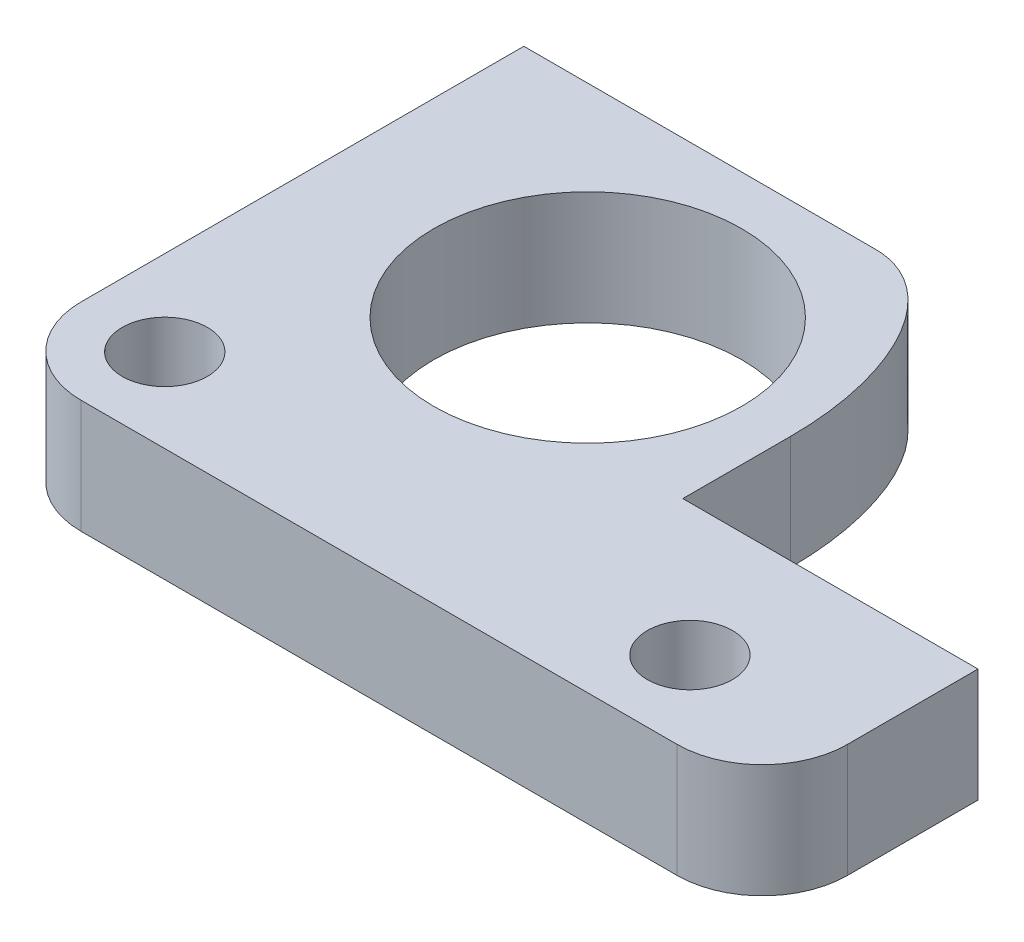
ISO-10303-21;
HEADER;
FILE_DESCRIPTION(('STEP AP214'),'2;1');
FILE_NAME('part.step','',(''),(''),'','','');
FILE_SCHEMA(('AUTOMOTIVE_DESIGN { 1 0 10303 214 1 1 1 1 }'));
ENDSEC;
DATA;
#1=APPLICATION_CONTEXT('core data for automotive mechanical design processes');
#2=APPLICATION_PROTOCOL_DEFINITION('international standard','automotive_design',2000,#1);
#3=PRODUCT_CONTEXT('',#1,'mechanical');
#4=PRODUCT('Part','Part','',(#3));
#5=PRODUCT_RELATED_PRODUCT_CATEGORY('part','',(#4));
#6=PRODUCT_DEFINITION_FORMATION('','',#4);
#7=PRODUCT_DEFINITION_CONTEXT('part definition',#1,'design');
#8=PRODUCT_DEFINITION('design','',#6,#7);
#9=PRODUCT_DEFINITION_SHAPE('','',#8);
#10=(LENGTH_UNIT() NAMED_UNIT(*) SI_UNIT(.MILLI.,.METRE.));
#11=(NAMED_UNIT(*) PLANE_ANGLE_UNIT() SI_UNIT($,.RADIAN.));
#12=(NAMED_UNIT(*) SI_UNIT($,.STERADIAN.) SOLID_ANGLE_UNIT());
#13=UNCERTAINTY_MEASURE_WITH_UNIT(LENGTH_MEASURE(1.E-05),#10,'distance_accuracy_value','');
#14=(GEOMETRIC_REPRESENTATION_CONTEXT(3) GLOBAL_UNCERTAINTY_ASSIGNED_CONTEXT((#13)) GLOBAL_UNIT_ASSIGNED_CONTEXT((#10,
#11,#12)) REPRESENTATION_CONTEXT('',''));
#15=CARTESIAN_POINT('',(0.,0.,0.));
#16=DIRECTION('',(0.,0.,1.));
#17=DIRECTION('',(1.,0.,0.));
#18=AXIS2_PLACEMENT_3D('',#15,#16,#17);
#19=CARTESIAN_POINT('',(0.,2.,0.));
#20=DIRECTION('',(0.,1.,0.));
#21=DIRECTION('',(0.,0.,1.));
#22=AXIS2_PLACEMENT_3D('',#19,#20,#21);
#23=PLANE('',#22);
#24=CARTESIAN_POINT('',(-4.1,2.,3.275));
#25=DIRECTION('',(0.,1.,0.));
#26=DIRECTION('',(0.,0.,1.));
#27=AXIS2_PLACEMENT_3D('',#24,#25,#26);
#28=CIRCLE('',#27,5.425);
#29=CARTESIAN_POINT('',(-4.1,2.,8.7));
#30=VERTEX_POINT('',#29);
#31=EDGE_CURVE('E223',#30,#30,#28,.F.);
#32=ORIENTED_EDGE('',*,*,#31,.T.);
#33=EDGE_LOOP('',(#32));
#34=FACE_BOUND('',#33,.T.);
#35=CARTESIAN_POINT('',(-10.5,2.,11.775));
#36=DIRECTION('',(0.,1.,0.));
#37=DIRECTION('',(0.,0.,1.));
#38=AXIS2_PLACEMENT_3D('',#35,#36,#37);
#39=CIRCLE('',#38,1.5);
#40=CARTESIAN_POINT('',(-10.5,2.,13.275));
#41=VERTEX_POINT('',#40);
#42=EDGE_CURVE('E316',#41,#41,#39,.F.);
#43=ORIENTED_EDGE('',*,*,#42,.T.);
#44=EDGE_LOOP('',(#43));
#45=FACE_BOUND('',#44,.T.);
#46=CARTESIAN_POINT('',(8.,2.,11.775));
#47=DIRECTION('',(0.,1.,0.));
#48=DIRECTION('',(0.,0.,1.));
#49=AXIS2_PLACEMENT_3D('',#46,#47,#48);
#50=CIRCLE('',#49,1.5);
#51=CARTESIAN_POINT('',(8.,2.,13.275));
#52=VERTEX_POINT('',#51);
#53=EDGE_CURVE('E288',#52,#52,#50,.F.);
#54=ORIENTED_EDGE('',*,*,#53,.T.);
#55=EDGE_LOOP('',(#54));
#56=FACE_BOUND('',#55,.T.);
#57=DIRECTION('',(0.,0.,-1.));
#58=VECTOR('',#57,1.);
#59=CARTESIAN_POINT('',(13.5,2.,11.725));
#60=LINE('',#59,#58);
#61=CARTESIAN_POINT('',(13.5,2.,7.125));
#62=VERTEX_POINT('',#61);
#63=CARTESIAN_POINT('',(13.5,2.,11.725));
#64=VERTEX_POINT('',#63);
#65=EDGE_CURVE('E130',#62,#64,#60,.F.);
#66=ORIENTED_EDGE('',*,*,#65,.F.);
#67=DIRECTION('',(-1.,0.,0.));
#68=VECTOR('',#67,1.);
#69=CARTESIAN_POINT('',(13.5,2.,7.125));
#70=LINE('',#69,#68);
#71=CARTESIAN_POINT('',(3.1,2.,7.125));
#72=VERTEX_POINT('',#71);
#73=EDGE_CURVE('E126',#72,#62,#70,.F.);
#74=ORIENTED_EDGE('',*,*,#73,.F.);
#75=DIRECTION('',(0.,0.,-1.));
#76=VECTOR('',#75,1.);
#77=CARTESIAN_POINT('',(3.1,2.,7.125));
#78=LINE('',#77,#76);
#79=CARTESIAN_POINT('',(3.10001855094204,2.,3.32500000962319));
#80=VERTEX_POINT('',#79);
#81=EDGE_CURVE('E113',#80,#72,#78,.F.);
#82=ORIENTED_EDGE('',*,*,#81,.F.);
#83=CARTESIAN_POINT('',(3.10003710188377,2.,3.32500001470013));
#84=CARTESIAN_POINT('',(3.10007453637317,2.,3.2140764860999));
#85=CARTESIAN_POINT('',(3.09861347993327,2.,3.10315693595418));
#86=CARTESIAN_POINT('',(3.09266903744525,2.,2.88139930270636));
#87=CARTESIAN_POINT('',(3.08818566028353,2.,2.77056121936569));
#88=CARTESIAN_POINT('',(3.07012608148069,2.,2.43757906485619));
#89=CARTESIAN_POINT('',(3.05193981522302,2.,2.21566843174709));
#90=CARTESIAN_POINT('',(3.00332272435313,2.,1.77290547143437));
#91=CARTESIAN_POINT('',(2.97287611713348,2.,1.55205488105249));
#92=CARTESIAN_POINT('',(2.89867700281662,2.,1.11027900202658));
#93=CARTESIAN_POINT('',(2.85479243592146,2.,0.88937575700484));
#94=CARTESIAN_POINT('',(2.7533377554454,2.,0.450930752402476));
#95=CARTESIAN_POINT('',(2.69578180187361,2.,0.233385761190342));
#96=CARTESIAN_POINT('',(2.5983834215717,2.,-0.0894541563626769));
#97=CARTESIAN_POINT('',(2.5640904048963,2.,-0.196442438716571));
#98=CARTESIAN_POINT('',(2.49171222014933,2.,-0.409127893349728));
#99=CARTESIAN_POINT('',(2.45362720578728,2.,-0.514825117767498));
#100=CARTESIAN_POINT('',(2.36121377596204,2.,-0.756757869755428));
#101=CARTESIAN_POINT('',(2.30547713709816,2.,-0.89245978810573));
#102=CARTESIAN_POINT('',(2.18676976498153,2.,-1.16067094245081));
#103=CARTESIAN_POINT('',(2.12379903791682,2.,-1.29318018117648));
#104=CARTESIAN_POINT('',(1.99027434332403,2.,-1.55414631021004));
#105=CARTESIAN_POINT('',(1.91972930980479,2.,-1.68260774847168));
#106=CARTESIAN_POINT('',(1.77028706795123,2.,-1.9345683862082));
#107=CARTESIAN_POINT('',(1.69139198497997,2.,-2.05806883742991));
#108=CARTESIAN_POINT('',(1.5371411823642,2.,-2.28103440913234));
#109=CARTESIAN_POINT('',(1.46300492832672,2.,-2.38134197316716));
#110=CARTESIAN_POINT('',(1.30784214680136,2.,-2.57655108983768));
#111=CARTESIAN_POINT('',(1.22681432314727,2.,-2.67145161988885));
#112=CARTESIAN_POINT('',(1.05764352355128,2.,-2.8544260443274));
#113=CARTESIAN_POINT('',(0.969511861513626,2.,-2.94251037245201));
#114=CARTESIAN_POINT('',(0.786057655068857,2.,-3.11083030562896));
#115=CARTESIAN_POINT('',(0.690739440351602,2.,-3.19107057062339));
#116=CARTESIAN_POINT('',(0.52610368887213,2.,-3.31567313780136));
#117=CARTESIAN_POINT('',(0.458989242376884,2.,-3.36294634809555));
#118=CARTESIAN_POINT('',(0.32139484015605,2.,-3.45232204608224));
#119=CARTESIAN_POINT('',(0.250915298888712,2.,-3.49442516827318));
#120=CARTESIAN_POINT('',(0.107044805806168,2.,-3.5728141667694));
#121=CARTESIAN_POINT('',(0.0336625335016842,2.,-3.60911595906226));
#122=CARTESIAN_POINT('',(-0.115826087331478,2.,-3.67563823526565));
#123=CARTESIAN_POINT('',(-0.191932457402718,2.,-3.70585867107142));
#124=CARTESIAN_POINT('',(-0.335691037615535,2.,-3.75556163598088));
#125=CARTESIAN_POINT('',(-0.403026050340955,2.,-3.77595674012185));
#126=CARTESIAN_POINT('',(-0.505045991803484,2.,-3.80252865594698));
#127=CARTESIAN_POINT('',(-0.539219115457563,2.,-3.81071528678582));
#128=CARTESIAN_POINT('',(-0.607861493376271,2.,-3.82574358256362));
#129=CARTESIAN_POINT('',(-0.642330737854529,2.,-3.83258529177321));
#130=CARTESIAN_POINT('',(-0.711793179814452,2.,-3.84484062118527));
#131=CARTESIAN_POINT('',(-0.746788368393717,2.,-3.85024300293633));
#132=CARTESIAN_POINT('',(-0.816989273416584,2.,-3.85948306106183));
#133=CARTESIAN_POINT('',(-0.852195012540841,2.,-3.86332056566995));
#134=CARTESIAN_POINT('',(-0.922802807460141,2.,-3.86941073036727));
#135=CARTESIAN_POINT('',(-0.958205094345,2.,-3.87166070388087));
#136=CARTESIAN_POINT('',(-1.02907290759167,2.,-3.87459281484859));
#137=CARTESIAN_POINT('',(-1.06453843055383,2.,-3.87527503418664));
#138=CARTESIAN_POINT('',(-1.10000043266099,2.,-3.87518725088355));
#139=B_SPLINE_CURVE_WITH_KNOTS('',3,(#83,#84,#85,#86,#87,#88,#89,#90,#91,#92,#93,#94,#95,#96,
#97,#98,#99,#100,#101,#102,#103,#104,#105,#106,#107,#108,#109,#110,#111,#112,#113,#114,#115,
#116,#117,#118,#119,#120,#121,#122,#123,#124,#125,#126,#127,#128,#129,#130,#131,#132,#133,#134,
#135,#136,#137,#138),.UNSPECIFIED.,.F.,.F.,(4,2,2,2,2,2,2,2,2,2,2,2,2,2,2,2,2,2,2,2,2,2,2,2,2,2,
2,4),(0.,0.332751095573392,0.665501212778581,1.33310256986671,2.00156608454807,2.67682196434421,
3.3513814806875,3.68837046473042,4.02534579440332,4.46525038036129,4.90515459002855,
5.34454551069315,5.78382485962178,6.1577554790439,6.53175658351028,6.90517337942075,
7.27836697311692,7.52443921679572,7.77048123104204,8.01583618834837,8.26119308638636,
8.47202715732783,8.57742538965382,8.68282015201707,8.78901521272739,8.89522192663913,
9.00160794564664,9.10798840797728),.UNSPECIFIED.);
#140=CARTESIAN_POINT('',(-1.10000021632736,2.,-3.87509362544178));
#141=VERTEX_POINT('',#140);
#142=EDGE_CURVE('E146',#80,#141,#139,.T.);
#143=ORIENTED_EDGE('',*,*,#142,.T.);
#144=DIRECTION('',(-1.,0.,0.));
#145=VECTOR('',#144,1.);
#146=CARTESIAN_POINT('',(-1.1,2.,-3.875));
#147=LINE('',#146,#145);
#148=CARTESIAN_POINT('',(-13.5,2.,-3.875));
#149=VERTEX_POINT('',#148);
#150=EDGE_CURVE('E171',#149,#141,#147,.F.);
#151=ORIENTED_EDGE('',*,*,#150,.F.);
#152=DIRECTION('',(0.,0.,1.));
#153=VECTOR('',#152,1.);
#154=CARTESIAN_POINT('',(-13.5,2.,-3.875));
#155=LINE('',#154,#153);
#156=CARTESIAN_POINT('',(-13.5,2.,11.725));
#157=VERTEX_POINT('',#156);
#158=EDGE_CURVE('E86',#157,#149,#155,.F.);
#159=ORIENTED_EDGE('',*,*,#158,.F.);
#160=CARTESIAN_POINT('',(-10.5,2.,11.725));
#161=DIRECTION('',(0.,1.,0.));
#162=DIRECTION('',(0.,0.,1.));
#163=AXIS2_PLACEMENT_3D('',#160,#161,#162);
#164=CIRCLE('',#163,3.);
#165=CARTESIAN_POINT('',(-10.5,2.,14.725));
#166=VERTEX_POINT('',#165);
#167=EDGE_CURVE('E78',#166,#157,#164,.F.);
#168=ORIENTED_EDGE('',*,*,#167,.F.);
#169=DIRECTION('',(1.,0.,0.));
#170=VECTOR('',#169,1.);
#171=CARTESIAN_POINT('',(-10.5,2.,14.725));
#172=LINE('',#171,#170);
#173=CARTESIAN_POINT('',(10.5,2.,14.725));
#174=VERTEX_POINT('',#173);
#175=EDGE_CURVE('E72',#174,#166,#172,.F.);
#176=ORIENTED_EDGE('',*,*,#175,.F.);
#177=CARTESIAN_POINT('',(10.5,2.,11.725));
#178=DIRECTION('',(0.,1.,0.));
#179=DIRECTION('',(0.,0.,1.));
#180=AXIS2_PLACEMENT_3D('',#177,#178,#179);
#181=CIRCLE('',#180,3.);
#182=EDGE_CURVE('E300',#64,#174,#181,.F.);
#183=ORIENTED_EDGE('',*,*,#182,.F.);
#184=EDGE_LOOP('',(#66,#74,#82,#143,#151,#159,#168,#176,#183));
#185=FACE_BOUND('',#184,.T.);
#186=ADVANCED_FACE('F17',(#34,#45,#56,#185),#23,.T.);
#187=CARTESIAN_POINT('',(13.5,-2.,7.125));
#188=DIRECTION('',(0.,0.,-1.));
#189=DIRECTION('',(-1.,0.,0.));
#190=AXIS2_PLACEMENT_3D('',#187,#188,#189);
#191=PLANE('',#190);
#192=DIRECTION('',(0.,1.,0.));
#193=VECTOR('',#192,1.);
#194=CARTESIAN_POINT('',(13.5,-2.,7.125));
#195=LINE('',#194,#193);
#196=CARTESIAN_POINT('',(13.5,-2.,7.125));
#197=VERTEX_POINT('',#196);
#198=EDGE_CURVE('E157',#197,#62,#195,.T.);
#199=ORIENTED_EDGE('',*,*,#198,.F.);
#200=DIRECTION('',(1.,0.,0.));
#201=VECTOR('',#200,1.);
#202=CARTESIAN_POINT('',(0.,-2.,7.125));
#203=LINE('',#202,#201);
#204=CARTESIAN_POINT('',(3.1,-2.,7.125));
#205=VERTEX_POINT('',#204);
#206=EDGE_CURVE('E139',#197,#205,#203,.F.);
#207=ORIENTED_EDGE('',*,*,#206,.T.);
#208=DIRECTION('',(0.,1.,0.));
#209=VECTOR('',#208,1.);
#210=CARTESIAN_POINT('',(3.1,-2.,7.125));
#211=LINE('',#210,#209);
#212=EDGE_CURVE('E118',#72,#205,#211,.F.);
#213=ORIENTED_EDGE('',*,*,#212,.F.);
#214=ORIENTED_EDGE('',*,*,#73,.T.);
#215=EDGE_LOOP('',(#199,#207,#213,#214));
#216=FACE_BOUND('',#215,.T.);
#217=ADVANCED_FACE('F137',(#216),#191,.T.);
#218=CARTESIAN_POINT('',(3.1,-2.,7.125));
#219=DIRECTION('',(1.,0.,0.));
#220=DIRECTION('',(0.,0.,-1.));
#221=AXIS2_PLACEMENT_3D('',#218,#219,#220);
#222=PLANE('',#221);
#223=ORIENTED_EDGE('',*,*,#212,.T.);
#224=DIRECTION('',(0.,0.,1.));
#225=VECTOR('',#224,1.);
#226=CARTESIAN_POINT('',(3.1,-2.,0.));
#227=LINE('',#226,#225);
#228=CARTESIAN_POINT('',(3.10001855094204,-2.,3.32500000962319));
#229=VERTEX_POINT('',#228);
#230=EDGE_CURVE('E281',#205,#229,#227,.F.);
#231=ORIENTED_EDGE('',*,*,#230,.T.);
#232=CARTESIAN_POINT('',(3.10003710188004,2.,3.3250000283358));
#233=DIRECTION('',(0.,-1.,0.));
#234=VECTOR('',#233,1.);
#235=LINE('',#232,#234);
#236=EDGE_CURVE('E120',#229,#80,#235,.F.);
#237=ORIENTED_EDGE('',*,*,#236,.T.);
#238=ORIENTED_EDGE('',*,*,#81,.T.);
#239=EDGE_LOOP('',(#223,#231,#237,#238));
#240=FACE_BOUND('',#239,.T.);
#241=ADVANCED_FACE('F115',(#240),#222,.T.);
#242=CARTESIAN_POINT('',(-1.231925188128,-2.,-3.871447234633));
#243=CARTESIAN_POINT('',(-0.9793425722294,-2.,-3.885054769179));
#244=CARTESIAN_POINT('',(-0.5480025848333,-2.,-3.835776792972));
#245=CARTESIAN_POINT('',(0.1671228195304,-2.,-3.584334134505));
#246=CARTESIAN_POINT('',(0.8789481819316,-2.,-3.081369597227));
#247=CARTESIAN_POINT('',(1.561186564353,-2.,-2.29964631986));
#248=CARTESIAN_POINT('',(2.10916645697,-2.,-1.378812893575));
#249=CARTESIAN_POINT('',(2.541157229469,-2.,-0.3377988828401));
#250=CARTESIAN_POINT('',(2.861422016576,-2.,0.8189785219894));
#251=CARTESIAN_POINT('',(3.06380102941,-2.,2.097901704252));
#252=CARTESIAN_POINT('',(3.107200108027,-2.,3.045344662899));
#253=CARTESIAN_POINT('',(3.097927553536,-2.,3.551157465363));
#254=(BOUNDED_CURVE() B_SPLINE_CURVE(3,(#242,#243,#244,#245,#246,#247,#248,#249,#250,#251,#252,
#253),.UNSPECIFIED.,.F.,.F.) B_SPLINE_CURVE_WITH_KNOTS((4,1,1,1,1,1,1,1,1,4),(0.,0.0625,0.125,
0.25,0.375,0.5,0.625,0.75,0.875,1.),
.UNSPECIFIED.) CURVE() GEOMETRIC_REPRESENTATION_ITEM() RATIONAL_B_SPLINE_CURVE((1.,1.,1.,1.,1.,
1.,1.,1.,1.,1.,1.,1.)) REPRESENTATION_ITEM(''));
#255=DIRECTION('',(0.,1.,0.));
#256=VECTOR('',#255,1.);
#257=SURFACE_OF_LINEAR_EXTRUSION('',#254,#256);
#258=ORIENTED_EDGE('',*,*,#142,.F.);
#259=ORIENTED_EDGE('',*,*,#236,.F.);
#260=CARTESIAN_POINT('',(3.10003710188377,-2.,3.32500001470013));
#261=CARTESIAN_POINT('',(3.10007453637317,-2.,3.2140764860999));
#262=CARTESIAN_POINT('',(3.09861347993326,-2.,3.10315693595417));
#263=CARTESIAN_POINT('',(3.09266903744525,-2.,2.88139930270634));
#264=CARTESIAN_POINT('',(3.08818566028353,-2.,2.77056121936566));
#265=CARTESIAN_POINT('',(3.07012608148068,-2.,2.43757906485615));
#266=CARTESIAN_POINT('',(3.05193981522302,-2.,2.21566843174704));
#267=CARTESIAN_POINT('',(3.00332272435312,-2.,1.77290547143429));
#268=CARTESIAN_POINT('',(2.97287611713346,-2.,1.5520548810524));
#269=CARTESIAN_POINT('',(2.8986770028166,-2.,1.11027900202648));
#270=CARTESIAN_POINT('',(2.85479243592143,-2.,0.889375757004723));
#271=CARTESIAN_POINT('',(2.75333775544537,-2.,0.450930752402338));
#272=CARTESIAN_POINT('',(2.69578180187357,-2.,0.233385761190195));
#273=CARTESIAN_POINT('',(2.59838342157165,-2.,-0.0894541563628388));
#274=CARTESIAN_POINT('',(2.56409040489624,-2.,-0.196442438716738));
#275=CARTESIAN_POINT('',(2.49171222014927,-2.,-0.409127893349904));
#276=CARTESIAN_POINT('',(2.45362720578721,-2.,-0.514825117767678));
#277=CARTESIAN_POINT('',(2.36121377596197,-2.,-0.756757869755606));
#278=CARTESIAN_POINT('',(2.30547713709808,-2.,-0.892459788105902));
#279=CARTESIAN_POINT('',(2.18676976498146,-2.,-1.16067094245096));
#280=CARTESIAN_POINT('',(2.12379903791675,-2.,-1.29318018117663));
#281=CARTESIAN_POINT('',(1.99027434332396,-2.,-1.55414631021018));
#282=CARTESIAN_POINT('',(1.91972930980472,-2.,-1.68260774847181));
#283=CARTESIAN_POINT('',(1.77028706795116,-2.,-1.93456838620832));
#284=CARTESIAN_POINT('',(1.69139198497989,-2.,-2.05806883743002));
#285=CARTESIAN_POINT('',(1.53714118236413,-2.,-2.28103440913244));
#286=CARTESIAN_POINT('',(1.46300492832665,-2.,-2.38134197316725));
#287=CARTESIAN_POINT('',(1.30784214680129,-2.,-2.57655108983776));
#288=CARTESIAN_POINT('',(1.2268143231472,-2.,-2.67145161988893));
#289=CARTESIAN_POINT('',(1.05764352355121,-2.,-2.85442604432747));
#290=CARTESIAN_POINT('',(0.969511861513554,-2.,-2.94251037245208));
#291=CARTESIAN_POINT('',(0.786057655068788,-2.,-3.11083030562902));
#292=CARTESIAN_POINT('',(0.690739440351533,-2.,-3.19107057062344));
#293=CARTESIAN_POINT('',(0.526103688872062,-2.,-3.31567313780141));
#294=CARTESIAN_POINT('',(0.458989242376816,-2.,-3.3629463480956));
#295=CARTESIAN_POINT('',(0.321394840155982,-2.,-3.45232204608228));
#296=CARTESIAN_POINT('',(0.250915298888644,-2.,-3.49442516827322));
#297=CARTESIAN_POINT('',(0.107044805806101,-2.,-3.57281416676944));
#298=CARTESIAN_POINT('',(0.0336625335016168,-2.,-3.60911595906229));
#299=CARTESIAN_POINT('',(-0.115826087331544,-2.,-3.67563823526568));
#300=CARTESIAN_POINT('',(-0.191932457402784,-2.,-3.70585867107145));
#301=CARTESIAN_POINT('',(-0.335691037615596,-2.,-3.75556163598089));
#302=CARTESIAN_POINT('',(-0.403026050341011,-2.,-3.77595674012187));
#303=CARTESIAN_POINT('',(-0.505045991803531,-2.,-3.80252865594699));
#304=CARTESIAN_POINT('',(-0.539219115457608,-2.,-3.81071528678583));
#305=CARTESIAN_POINT('',(-0.60786149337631,-2.,-3.82574358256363));
#306=CARTESIAN_POINT('',(-0.642330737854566,-2.,-3.83258529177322));
#307=CARTESIAN_POINT('',(-0.711793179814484,-2.,-3.84484062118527));
#308=CARTESIAN_POINT('',(-0.746788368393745,-2.,-3.85024300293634));
#309=CARTESIAN_POINT('',(-0.816989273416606,-2.,-3.85948306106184));
#310=CARTESIAN_POINT('',(-0.85219501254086,-2.,-3.86332056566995));
#311=CARTESIAN_POINT('',(-0.922802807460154,-2.,-3.86941073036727));
#312=CARTESIAN_POINT('',(-0.958205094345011,-2.,-3.87166070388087));
#313=CARTESIAN_POINT('',(-1.02907290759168,-2.,-3.8745928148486));
#314=CARTESIAN_POINT('',(-1.06453843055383,-2.,-3.87527503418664));
#315=CARTESIAN_POINT('',(-1.10000043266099,-2.,-3.87518725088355));
#316=B_SPLINE_CURVE_WITH_KNOTS('',3,(#260,#261,#262,#263,#264,#265,#266,#267,#268,#269,#270,
#271,#272,#273,#274,#275,#276,#277,#278,#279,#280,#281,#282,#283,#284,#285,#286,#287,#288,#289,
#290,#291,#292,#293,#294,#295,#296,#297,#298,#299,#300,#301,#302,#303,#304,#305,#306,#307,#308,
#309,#310,#311,#312,#313,#314,#315),.UNSPECIFIED.,.F.,.F.,(4,2,2,2,2,2,2,2,2,2,2,2,2,2,2,2,2,2,
2,2,2,2,2,2,2,2,2,4),(0.,0.332751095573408,0.665501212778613,1.33310256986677,2.00156608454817,
2.67682196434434,3.35138148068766,3.6883704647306,4.02534579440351,4.46525038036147,
4.90515459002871,5.34454551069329,5.78382485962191,6.15775547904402,6.53175658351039,
6.90517337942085,7.27836697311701,7.5244392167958,7.77048123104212,8.01583618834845,
8.26119308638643,8.47202715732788,8.57742538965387,8.6828201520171,8.78901521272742,
8.89522192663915,9.00160794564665,9.10798840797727),.UNSPECIFIED.);
#317=CARTESIAN_POINT('',(-1.10000021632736,-2.,-3.87509362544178));
#318=VERTEX_POINT('',#317);
#319=EDGE_CURVE('E221',#229,#318,#316,.T.);
#320=ORIENTED_EDGE('',*,*,#319,.T.);
#321=CARTESIAN_POINT('',(-1.10000043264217,-2.,-3.87518725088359));
#322=DIRECTION('',(0.,1.,0.));
#323=VECTOR('',#322,1.);
#324=LINE('',#321,#323);
#325=EDGE_CURVE('E168',#141,#318,#324,.F.);
#326=ORIENTED_EDGE('',*,*,#325,.F.);
#327=EDGE_LOOP('',(#258,#259,#320,#326));
#328=FACE_BOUND('',#327,.T.);
#329=ADVANCED_FACE('F197',(#328),#257,.F.);
#330=CARTESIAN_POINT('',(-1.1,-2.,-3.875));
#331=DIRECTION('',(0.,0.,-1.));
#332=DIRECTION('',(-1.,0.,0.));
#333=AXIS2_PLACEMENT_3D('',#330,#331,#332);
#334=PLANE('',#333);
#335=ORIENTED_EDGE('',*,*,#325,.T.);
#336=DIRECTION('',(1.,0.,0.));
#337=VECTOR('',#336,1.);
#338=CARTESIAN_POINT('',(0.,-2.,-3.875));
#339=LINE('',#338,#337);
#340=CARTESIAN_POINT('',(-13.5,-2.,-3.875));
#341=VERTEX_POINT('',#340);
#342=EDGE_CURVE('E270',#318,#341,#339,.F.);
#343=ORIENTED_EDGE('',*,*,#342,.T.);
#344=DIRECTION('',(0.,1.,0.));
#345=VECTOR('',#344,1.);
#346=CARTESIAN_POINT('',(-13.5,-2.,-3.875));
#347=LINE('',#346,#345);
#348=EDGE_CURVE('E167',#149,#341,#347,.F.);
#349=ORIENTED_EDGE('',*,*,#348,.F.);
#350=ORIENTED_EDGE('',*,*,#150,.T.);
#351=EDGE_LOOP('',(#335,#343,#349,#350));
#352=FACE_BOUND('',#351,.T.);
#353=ADVANCED_FACE('F187',(#352),#334,.T.);
#354=CARTESIAN_POINT('',(-13.5,-2.,-3.875));
#355=DIRECTION('',(-1.,0.,0.));
#356=DIRECTION('',(0.,0.,1.));
#357=AXIS2_PLACEMENT_3D('',#354,#355,#356);
#358=PLANE('',#357);
#359=ORIENTED_EDGE('',*,*,#348,.T.);
#360=DIRECTION('',(0.,0.,1.));
#361=VECTOR('',#360,1.);
#362=CARTESIAN_POINT('',(-13.5,-2.,0.));
#363=LINE('',#362,#361);
#364=CARTESIAN_POINT('',(-13.5,-2.,11.725));
#365=VERTEX_POINT('',#364);
#366=EDGE_CURVE('E266',#341,#365,#363,.T.);
#367=ORIENTED_EDGE('',*,*,#366,.T.);
#368=DIRECTION('',(0.,1.,0.));
#369=VECTOR('',#368,1.);
#370=CARTESIAN_POINT('',(-13.5,-2.,11.725));
#371=LINE('',#370,#369);
#372=EDGE_CURVE('E165',#157,#365,#371,.F.);
#373=ORIENTED_EDGE('',*,*,#372,.F.);
#374=ORIENTED_EDGE('',*,*,#158,.T.);
#375=EDGE_LOOP('',(#359,#367,#373,#374));
#376=FACE_BOUND('',#375,.T.);
#377=ADVANCED_FACE('F196',(#376),#358,.T.);
#378=CARTESIAN_POINT('',(-10.5,-2.,11.725));
#379=DIRECTION('',(0.,1.,0.));
#380=DIRECTION('',(0.,0.,1.));
#381=AXIS2_PLACEMENT_3D('',#378,#379,#380);
#382=CYLINDRICAL_SURFACE('',#381,3.);
#383=ORIENTED_EDGE('',*,*,#372,.T.);
#384=CARTESIAN_POINT('',(-10.5,-2.,11.725));
#385=DIRECTION('',(0.,1.,0.));
#386=DIRECTION('',(0.,0.,1.));
#387=AXIS2_PLACEMENT_3D('',#384,#385,#386);
#388=CIRCLE('',#387,3.);
#389=CARTESIAN_POINT('',(-10.5,-2.,14.725));
#390=VERTEX_POINT('',#389);
#391=EDGE_CURVE('E259',#365,#390,#388,.T.);
#392=ORIENTED_EDGE('',*,*,#391,.T.);
#393=DIRECTION('',(0.,1.,0.));
#394=VECTOR('',#393,1.);
#395=CARTESIAN_POINT('',(-10.5,-2.,14.725));
#396=LINE('',#395,#394);
#397=EDGE_CURVE('E164',#166,#390,#396,.F.);
#398=ORIENTED_EDGE('',*,*,#397,.F.);
#399=ORIENTED_EDGE('',*,*,#167,.T.);
#400=EDGE_LOOP('',(#383,#392,#398,#399));
#401=FACE_BOUND('',#400,.T.);
#402=ADVANCED_FACE('F251',(#401),#382,.T.);
#403=CARTESIAN_POINT('',(-10.5,-2.,14.725));
#404=DIRECTION('',(0.,0.,1.));
#405=DIRECTION('',(1.,0.,0.));
#406=AXIS2_PLACEMENT_3D('',#403,#404,#405);
#407=PLANE('',#406);
#408=ORIENTED_EDGE('',*,*,#397,.T.);
#409=DIRECTION('',(1.,0.,0.));
#410=VECTOR('',#409,1.);
#411=CARTESIAN_POINT('',(0.,-2.,14.725));
#412=LINE('',#411,#410);
#413=CARTESIAN_POINT('',(10.5,-2.,14.725));
#414=VERTEX_POINT('',#413);
#415=EDGE_CURVE('E268',#390,#414,#412,.T.);
#416=ORIENTED_EDGE('',*,*,#415,.T.);
#417=DIRECTION('',(0.,1.,0.));
#418=VECTOR('',#417,1.);
#419=CARTESIAN_POINT('',(10.5,-2.,14.725));
#420=LINE('',#419,#418);
#421=EDGE_CURVE('E291',#174,#414,#420,.F.);
#422=ORIENTED_EDGE('',*,*,#421,.F.);
#423=ORIENTED_EDGE('',*,*,#175,.T.);
#424=EDGE_LOOP('',(#408,#416,#422,#423));
#425=FACE_BOUND('',#424,.T.);
#426=ADVANCED_FACE('F248',(#425),#407,.T.);
#427=CARTESIAN_POINT('',(10.5,-2.,11.725));
#428=DIRECTION('',(0.,1.,0.));
#429=DIRECTION('',(0.,0.,1.));
#430=AXIS2_PLACEMENT_3D('',#427,#428,#429);
#431=CYLINDRICAL_SURFACE('',#430,3.);
#432=ORIENTED_EDGE('',*,*,#421,.T.);
#433=CARTESIAN_POINT('',(10.5,-2.,11.725));
#434=DIRECTION('',(0.,1.,0.));
#435=DIRECTION('',(0.,0.,1.));
#436=AXIS2_PLACEMENT_3D('',#433,#434,#435);
#437=CIRCLE('',#436,3.);
#438=CARTESIAN_POINT('',(13.5,-2.,11.725));
#439=VERTEX_POINT('',#438);
#440=EDGE_CURVE('E319',#414,#439,#437,.T.);
#441=ORIENTED_EDGE('',*,*,#440,.T.);
#442=DIRECTION('',(0.,1.,0.));
#443=VECTOR('',#442,1.);
#444=CARTESIAN_POINT('',(13.5,-2.,11.725));
#445=LINE('',#444,#443);
#446=EDGE_CURVE('E45',#64,#439,#445,.F.);
#447=ORIENTED_EDGE('',*,*,#446,.F.);
#448=ORIENTED_EDGE('',*,*,#182,.T.);
#449=EDGE_LOOP('',(#432,#441,#447,#448));
#450=FACE_BOUND('',#449,.T.);
#451=ADVANCED_FACE('F245',(#450),#431,.T.);
#452=CARTESIAN_POINT('',(13.5,-2.,11.725));
#453=DIRECTION('',(1.,0.,0.));
#454=DIRECTION('',(0.,0.,-1.));
#455=AXIS2_PLACEMENT_3D('',#452,#453,#454);
#456=PLANE('',#455);
#457=ORIENTED_EDGE('',*,*,#446,.T.);
#458=DIRECTION('',(0.,0.,1.));
#459=VECTOR('',#458,1.);
#460=CARTESIAN_POINT('',(13.5,-2.,0.));
#461=LINE('',#460,#459);
#462=EDGE_CURVE('E322',#439,#197,#461,.F.);
#463=ORIENTED_EDGE('',*,*,#462,.T.);
#464=ORIENTED_EDGE('',*,*,#198,.T.);
#465=ORIENTED_EDGE('',*,*,#65,.T.);
#466=EDGE_LOOP('',(#457,#463,#464,#465));
#467=FACE_BOUND('',#466,.T.);
#468=ADVANCED_FACE('F241',(#467),#456,.T.);
#469=CARTESIAN_POINT('',(8.,-2.,11.775));
#470=DIRECTION('',(0.,1.,0.));
#471=DIRECTION('',(0.,0.,1.));
#472=AXIS2_PLACEMENT_3D('',#469,#470,#471);
#473=CYLINDRICAL_SURFACE('',#472,1.5);
#474=ORIENTED_EDGE('',*,*,#53,.F.);
#475=EDGE_LOOP('',(#474));
#476=FACE_BOUND('',#475,.T.);
#477=CARTESIAN_POINT('',(8.,-2.,11.775));
#478=DIRECTION('',(0.,1.,0.));
#479=DIRECTION('',(0.,0.,1.));
#480=AXIS2_PLACEMENT_3D('',#477,#478,#479);
#481=CIRCLE('',#480,1.5);
#482=CARTESIAN_POINT('',(8.,-2.,13.275));
#483=VERTEX_POINT('',#482);
#484=EDGE_CURVE('E324',#483,#483,#481,.F.);
#485=ORIENTED_EDGE('',*,*,#484,.T.);
#486=EDGE_LOOP('',(#485));
#487=FACE_BOUND('',#486,.T.);
#488=ADVANCED_FACE('F237',(#476,#487),#473,.F.);
#489=CARTESIAN_POINT('',(-10.5,-2.,11.775));
#490=DIRECTION('',(0.,1.,0.));
#491=DIRECTION('',(0.,0.,1.));
#492=AXIS2_PLACEMENT_3D('',#489,#490,#491);
#493=CYLINDRICAL_SURFACE('',#492,1.5);
#494=ORIENTED_EDGE('',*,*,#42,.F.);
#495=EDGE_LOOP('',(#494));
#496=FACE_BOUND('',#495,.T.);
#497=CARTESIAN_POINT('',(-10.5,-2.,11.775));
#498=DIRECTION('',(0.,1.,0.));
#499=DIRECTION('',(0.,0.,1.));
#500=AXIS2_PLACEMENT_3D('',#497,#498,#499);
#501=CIRCLE('',#500,1.5);
#502=CARTESIAN_POINT('',(-10.5,-2.,13.275));
#503=VERTEX_POINT('',#502);
#504=EDGE_CURVE('E32',#503,#503,#501,.F.);
#505=ORIENTED_EDGE('',*,*,#504,.T.);
#506=EDGE_LOOP('',(#505));
#507=FACE_BOUND('',#506,.T.);
#508=ADVANCED_FACE('F233',(#496,#507),#493,.F.);
#509=CARTESIAN_POINT('',(-4.1,-2.,3.275));
#510=DIRECTION('',(0.,1.,0.));
#511=DIRECTION('',(0.,0.,1.));
#512=AXIS2_PLACEMENT_3D('',#509,#510,#511);
#513=CYLINDRICAL_SURFACE('',#512,5.425);
#514=ORIENTED_EDGE('',*,*,#31,.F.);
#515=EDGE_LOOP('',(#514));
#516=FACE_BOUND('',#515,.T.);
#517=CARTESIAN_POINT('',(-4.1,-2.,3.275));
#518=DIRECTION('',(0.,1.,0.));
#519=DIRECTION('',(0.,0.,1.));
#520=AXIS2_PLACEMENT_3D('',#517,#518,#519);
#521=CIRCLE('',#520,5.425);
#522=CARTESIAN_POINT('',(-4.1,-2.,8.7));
#523=VERTEX_POINT('',#522);
#524=EDGE_CURVE('E11',#523,#523,#521,.F.);
#525=ORIENTED_EDGE('',*,*,#524,.T.);
#526=EDGE_LOOP('',(#525));
#527=FACE_BOUND('',#526,.T.);
#528=ADVANCED_FACE('F229',(#516,#527),#513,.F.);
#529=CARTESIAN_POINT('',(0.,-2.,0.));
#530=DIRECTION('',(0.,1.,0.));
#531=DIRECTION('',(0.,0.,1.));
#532=AXIS2_PLACEMENT_3D('',#529,#530,#531);
#533=PLANE('',#532);
#534=ORIENTED_EDGE('',*,*,#524,.F.);
#535=EDGE_LOOP('',(#534));
#536=FACE_BOUND('',#535,.T.);
#537=ORIENTED_EDGE('',*,*,#504,.F.);
#538=EDGE_LOOP('',(#537));
#539=FACE_BOUND('',#538,.T.);
#540=ORIENTED_EDGE('',*,*,#484,.F.);
#541=EDGE_LOOP('',(#540));
#542=FACE_BOUND('',#541,.T.);
#543=ORIENTED_EDGE('',*,*,#440,.F.);
#544=ORIENTED_EDGE('',*,*,#415,.F.);
#545=ORIENTED_EDGE('',*,*,#391,.F.);
#546=ORIENTED_EDGE('',*,*,#366,.F.);
#547=ORIENTED_EDGE('',*,*,#342,.F.);
#548=ORIENTED_EDGE('',*,*,#319,.F.);
#549=ORIENTED_EDGE('',*,*,#230,.F.);
#550=ORIENTED_EDGE('',*,*,#206,.F.);
#551=ORIENTED_EDGE('',*,*,#462,.F.);
#552=EDGE_LOOP('',(#543,#544,#545,#546,#547,#548,#549,#550,#551));
#553=FACE_BOUND('',#552,.T.);
#554=ADVANCED_FACE('F225',(#536,#539,#542,#553),#533,.F.);
#555=CLOSED_SHELL('',(#186,#217,#241,#329,#353,#377,#402,#426,#451,#468,#488,#508,#528,#554));
#556=MANIFOLD_SOLID_BREP('B1',#555);
#557=ADVANCED_BREP_SHAPE_REPRESENTATION('',(#18,#556),#14);
#558=SHAPE_DEFINITION_REPRESENTATION(#9,#557);
ENDSEC;
END-ISO-10303-21;
